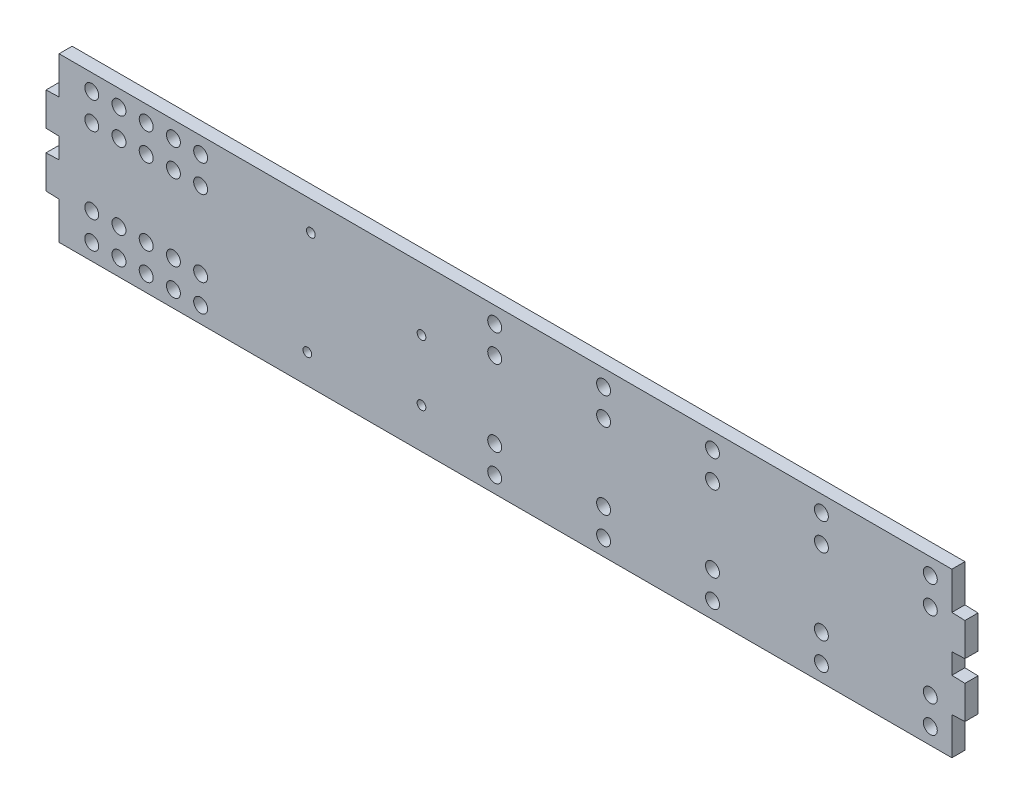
from build123d import *

# Parameters (mm, degrees)
SKETCH1_W                   = 409.9
SKETCH1_H                   = 75
BOSS_EXTRUDE1_DEPTH         = 3
BOSS_EXTRUDE2_DEPTH         = 6
THREADED_INSERT_HOLES_REACH = 216.898
SKETCH4_R                   = 2
SKETCH5_R                   = 3.2
WIRE_ANCHOR_HOLES_DEPTH     = 6


with BuildPart() as part:
    # Sketch1 → Boss-Extrude1 (new, symmetric)
    with BuildSketch(Plane.XY):
        with Locations((-0.05, -2.8)):
            Rectangle(SKETCH1_W, SKETCH1_H)
    extrude(amount=BOSS_EXTRUDE1_DEPTH, both=True)

    # Sketch2 → Boss-Extrude2 (add)
    with BuildSketch(Plane.XY.offset(3)):
        Polygon((-205, 1.890475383), (-205, 17.509524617), (-211, 17.3), (-211, 2.1), align=None)
        Polygon((-205, -23.109524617), (-205, -7.490475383), (-211, -7.7), (-211, -22.9), align=None)
        Polygon((204.9, 1.890475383), (204.9, 17.509524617), (210.9, 17.3), (210.9, 2.1), align=None)
        Polygon((204.9, -23.109524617), (204.9, -7.490475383), (210.9, -7.7), (210.9, -22.9), align=None)
    extrude(amount=-BOSS_EXTRUDE2_DEPTH)

    # Sketch4 → threaded insert holes (cut, up to next)
    with BuildSketch(Plane.XY.offset(3), mode=Mode.PRIVATE) as threaded_insert_holes_sk1:
        with Locations((-91, -26.95)):
            Circle(SKETCH4_R)
    threaded_insert_holes_tool1 = extrude(threaded_insert_holes_sk1.sketch, amount=-THREADED_INSERT_HOLES_REACH, mode=Mode.PRIVATE) & part.part
    # Sketch4 → threaded insert holes (cut, up to next)
    with BuildSketch(Plane.XY.offset(3), mode=Mode.PRIVATE) as threaded_insert_holes_sk2:
        with Locations((-89.4, 21.35)):
            Circle(SKETCH4_R)
    threaded_insert_holes_tool2 = extrude(threaded_insert_holes_sk2.sketch, amount=-THREADED_INSERT_HOLES_REACH, mode=Mode.PRIVATE) & part.part
    # Sketch4 → threaded insert holes (cut, up to next)
    with BuildSketch(Plane.XY.offset(3), mode=Mode.PRIVATE) as threaded_insert_holes_sk3:
        with Locations((-38.6, 6.05)):
            Circle(SKETCH4_R)
    threaded_insert_holes_tool3 = extrude(threaded_insert_holes_sk3.sketch, amount=-THREADED_INSERT_HOLES_REACH, mode=Mode.PRIVATE) & part.part
    # Sketch4 → threaded insert holes (cut, up to next)
    with BuildSketch(Plane.XY.offset(3), mode=Mode.PRIVATE) as threaded_insert_holes_sk4:
        with Locations((-38.6, -21.85)):
            Circle(SKETCH4_R)
    threaded_insert_holes_tool4 = extrude(threaded_insert_holes_sk4.sketch, amount=-THREADED_INSERT_HOLES_REACH, mode=Mode.PRIVATE) & part.part
    add(threaded_insert_holes_tool1.solids().sort_by_distance((-91, -26.95, 3))[0], mode=Mode.SUBTRACT)
    add(threaded_insert_holes_tool2.solids().sort_by_distance((-89.4, 21.35, 3))[0], mode=Mode.SUBTRACT)
    add(threaded_insert_holes_tool3.solids().sort_by_distance((-38.6, 6.05, 3))[0], mode=Mode.SUBTRACT)
    add(threaded_insert_holes_tool4.solids().sort_by_distance((-38.6, -21.85, 3))[0], mode=Mode.SUBTRACT)

    # Sketch5 → wire anchor holes (cut)
    with BuildSketch(Plane.XY.offset(3)):
        with Locations((-190, 27.2)):
            Circle(SKETCH5_R)
        with Locations((-177.5, 27.2)):
            Circle(SKETCH5_R)
        with Locations((-165, 27.2)):
            Circle(SKETCH5_R)
        with Locations((-152.5, 27.2)):
            Circle(SKETCH5_R)
        with Locations((-140, 27.2)):
            Circle(SKETCH5_R)
        with Locations((-177.5, 14.7)):
            Circle(SKETCH5_R)
        with Locations((-165, 14.7)):
            Circle(SKETCH5_R)
        with Locations((-152.5, 14.7)):
            Circle(SKETCH5_R)
        with Locations((-140, 14.7)):
            Circle(SKETCH5_R)
        with Locations((-190, 14.7)):
            Circle(SKETCH5_R)
        with Locations((-5, 27.2)):
            Circle(SKETCH5_R)
        with Locations((45, 27.2)):
            Circle(SKETCH5_R)
        with Locations((95, 27.2)):
            Circle(SKETCH5_R)
        with Locations((145, 27.2)):
            Circle(SKETCH5_R)
        with Locations((45, 14.7)):
            Circle(SKETCH5_R)
        with Locations((95, 14.7)):
            Circle(SKETCH5_R)
        with Locations((145, 14.7)):
            Circle(SKETCH5_R)
        with Locations((-5, 14.7)):
            Circle(SKETCH5_R)
        with Locations((-5, -20.3)):
            Circle(SKETCH5_R)
        with Locations((145, -20.3)):
            Circle(SKETCH5_R)
        with Locations((95, -20.3)):
            Circle(SKETCH5_R)
        with Locations((45, -20.3)):
            Circle(SKETCH5_R)
        with Locations((145, -32.8)):
            Circle(SKETCH5_R)
        with Locations((95, -32.8)):
            Circle(SKETCH5_R)
        with Locations((45, -32.8)):
            Circle(SKETCH5_R)
        with Locations((-5, -32.8)):
            Circle(SKETCH5_R)
        with Locations((-190, -20.3)):
            Circle(SKETCH5_R)
        with Locations((-140, -20.3)):
            Circle(SKETCH5_R)
        with Locations((-152.5, -20.3)):
            Circle(SKETCH5_R)
        with Locations((-165, -20.3)):
            Circle(SKETCH5_R)
        with Locations((-177.5, -20.3)):
            Circle(SKETCH5_R)
        with Locations((-140, -32.8)):
            Circle(SKETCH5_R)
        with Locations((-152.5, -32.8)):
            Circle(SKETCH5_R)
        with Locations((-165, -32.8)):
            Circle(SKETCH5_R)
        with Locations((-177.5, -32.8)):
            Circle(SKETCH5_R)
        with Locations((-190, -32.8)):
            Circle(SKETCH5_R)
        with Locations((195, 27.2)):
            Circle(SKETCH5_R)
        with Locations((195, 14.7)):
            Circle(SKETCH5_R)
        with Locations((195, -20.3)):
            Circle(SKETCH5_R)
        with Locations((195, -32.8)):
            Circle(SKETCH5_R)
    extrude(amount=-WIRE_ANCHOR_HOLES_DEPTH, mode=Mode.SUBTRACT)


solid = part.part
